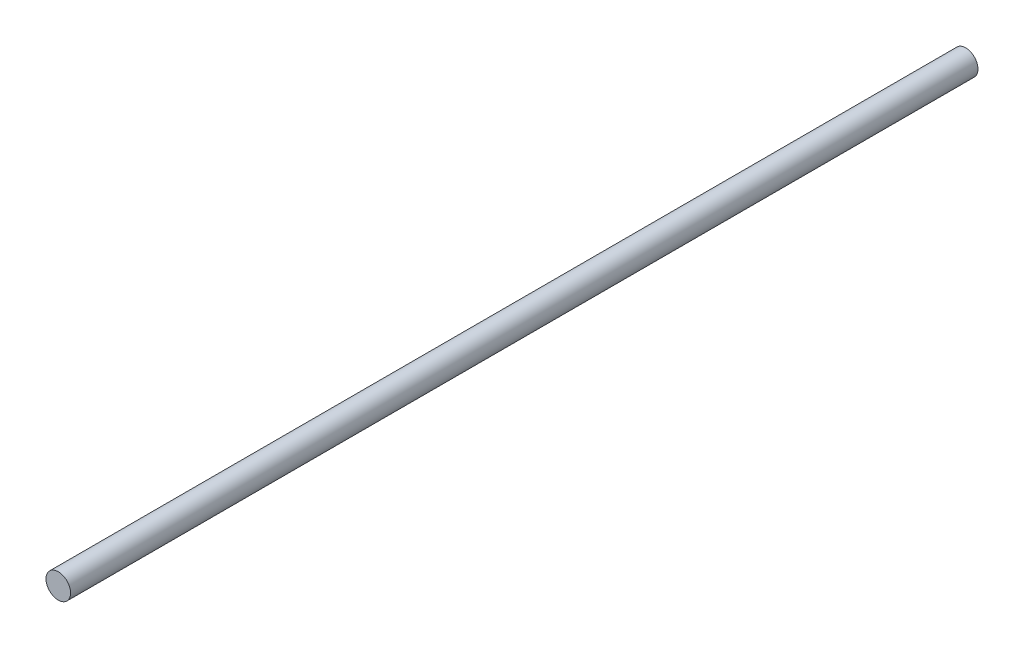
ISO-10303-21;
HEADER;
FILE_DESCRIPTION(('STEP AP214'),'2;1');
FILE_NAME('part.step','',(''),(''),'','','');
FILE_SCHEMA(('AUTOMOTIVE_DESIGN { 1 0 10303 214 1 1 1 1 }'));
ENDSEC;
DATA;
#1=APPLICATION_CONTEXT('core data for automotive mechanical design processes');
#2=APPLICATION_PROTOCOL_DEFINITION('international standard','automotive_design',2000,#1);
#3=PRODUCT_CONTEXT('',#1,'mechanical');
#4=PRODUCT('Part','Part','',(#3));
#5=PRODUCT_RELATED_PRODUCT_CATEGORY('part','',(#4));
#6=PRODUCT_DEFINITION_FORMATION('','',#4);
#7=PRODUCT_DEFINITION_CONTEXT('part definition',#1,'design');
#8=PRODUCT_DEFINITION('design','',#6,#7);
#9=PRODUCT_DEFINITION_SHAPE('','',#8);
#10=(LENGTH_UNIT() NAMED_UNIT(*) SI_UNIT(.MILLI.,.METRE.));
#11=(NAMED_UNIT(*) PLANE_ANGLE_UNIT() SI_UNIT($,.RADIAN.));
#12=(NAMED_UNIT(*) SI_UNIT($,.STERADIAN.) SOLID_ANGLE_UNIT());
#13=UNCERTAINTY_MEASURE_WITH_UNIT(LENGTH_MEASURE(1.E-05),#10,'distance_accuracy_value','');
#14=(GEOMETRIC_REPRESENTATION_CONTEXT(3) GLOBAL_UNCERTAINTY_ASSIGNED_CONTEXT((#13)) GLOBAL_UNIT_ASSIGNED_CONTEXT((#10,
#11,#12)) REPRESENTATION_CONTEXT('',''));
#15=CARTESIAN_POINT('',(0.,0.,0.));
#16=DIRECTION('',(0.,0.,1.));
#17=DIRECTION('',(1.,0.,0.));
#18=AXIS2_PLACEMENT_3D('',#15,#16,#17);
#19=CARTESIAN_POINT('',(0.,0.,-147.5));
#20=DIRECTION('',(0.,0.,1.));
#21=DIRECTION('',(1.,0.,0.));
#22=AXIS2_PLACEMENT_3D('',#19,#20,#21);
#23=CYLINDRICAL_SURFACE('',#22,4.);
#24=CARTESIAN_POINT('',(0.,0.,-147.5));
#25=DIRECTION('',(0.,0.,1.));
#26=DIRECTION('',(1.,0.,0.));
#27=AXIS2_PLACEMENT_3D('',#24,#25,#26);
#28=CIRCLE('',#27,4.);
#29=CARTESIAN_POINT('',(4.,0.,-147.5));
#30=VERTEX_POINT('',#29);
#31=EDGE_CURVE('E10',#30,#30,#28,.T.);
#32=ORIENTED_EDGE('',*,*,#31,.T.);
#33=EDGE_LOOP('',(#32));
#34=FACE_BOUND('',#33,.T.);
#35=CARTESIAN_POINT('',(0.,0.,147.5));
#36=DIRECTION('',(0.,0.,1.));
#37=DIRECTION('',(1.,0.,0.));
#38=AXIS2_PLACEMENT_3D('',#35,#36,#37);
#39=CIRCLE('',#38,4.);
#40=CARTESIAN_POINT('',(4.,0.,147.5));
#41=VERTEX_POINT('',#40);
#42=EDGE_CURVE('E34',#41,#41,#39,.T.);
#43=ORIENTED_EDGE('',*,*,#42,.F.);
#44=EDGE_LOOP('',(#43));
#45=FACE_BOUND('',#44,.T.);
#46=ADVANCED_FACE('F28',(#34,#45),#23,.T.);
#47=CARTESIAN_POINT('',(0.,0.,-147.5));
#48=DIRECTION('',(0.,0.,1.));
#49=DIRECTION('',(1.,0.,0.));
#50=AXIS2_PLACEMENT_3D('',#47,#48,#49);
#51=PLANE('',#50);
#52=ORIENTED_EDGE('',*,*,#31,.F.);
#53=EDGE_LOOP('',(#52));
#54=FACE_BOUND('',#53,.T.);
#55=ADVANCED_FACE('F43',(#54),#51,.F.);
#56=CARTESIAN_POINT('',(0.,0.,147.5));
#57=DIRECTION('',(0.,0.,1.));
#58=DIRECTION('',(1.,0.,0.));
#59=AXIS2_PLACEMENT_3D('',#56,#57,#58);
#60=PLANE('',#59);
#61=ORIENTED_EDGE('',*,*,#42,.T.);
#62=EDGE_LOOP('',(#61));
#63=FACE_BOUND('',#62,.T.);
#64=ADVANCED_FACE('F40',(#63),#60,.T.);
#65=CLOSED_SHELL('',(#46,#55,#64));
#66=MANIFOLD_SOLID_BREP('B2',#65);
#67=ADVANCED_BREP_SHAPE_REPRESENTATION('',(#18,#66),#14);
#68=SHAPE_DEFINITION_REPRESENTATION(#9,#67);
ENDSEC;
END-ISO-10303-21;
